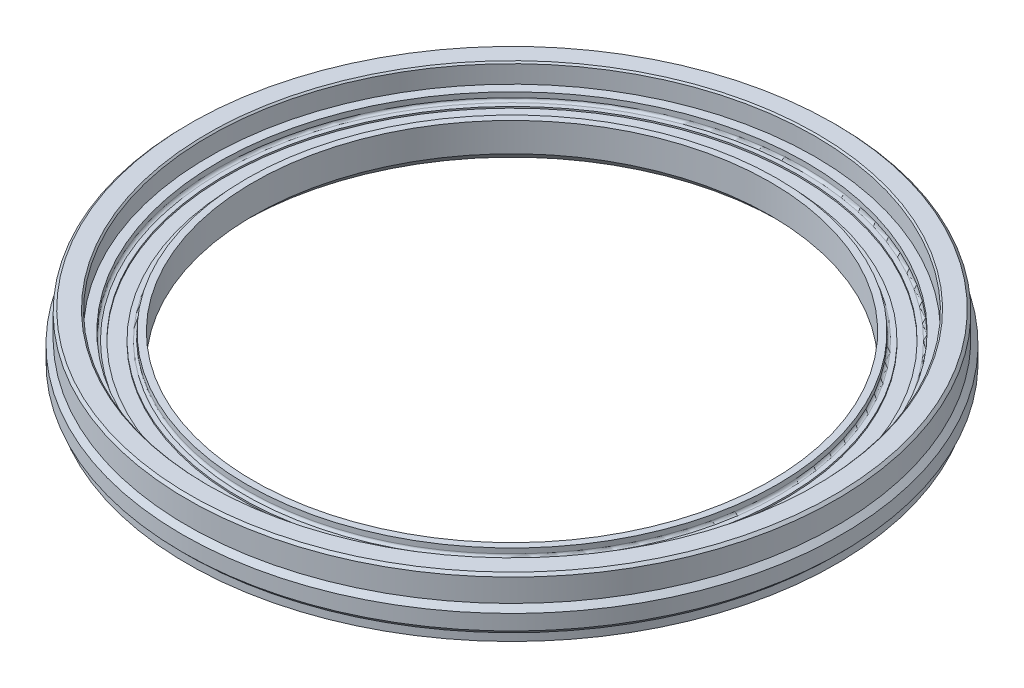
ISO-10303-21;
HEADER;
FILE_DESCRIPTION(('STEP AP214'),'2;1');
FILE_NAME('part.step','',(''),(''),'','','');
FILE_SCHEMA(('AUTOMOTIVE_DESIGN { 1 0 10303 214 1 1 1 1 }'));
ENDSEC;
DATA;
#1=APPLICATION_CONTEXT('core data for automotive mechanical design processes');
#2=APPLICATION_PROTOCOL_DEFINITION('international standard','automotive_design',2000,#1);
#3=PRODUCT_CONTEXT('',#1,'mechanical');
#4=PRODUCT('Part','Part','',(#3));
#5=PRODUCT_RELATED_PRODUCT_CATEGORY('part','',(#4));
#6=PRODUCT_DEFINITION_FORMATION('','',#4);
#7=PRODUCT_DEFINITION_CONTEXT('part definition',#1,'design');
#8=PRODUCT_DEFINITION('design','',#6,#7);
#9=PRODUCT_DEFINITION_SHAPE('','',#8);
#10=(LENGTH_UNIT() NAMED_UNIT(*) SI_UNIT(.MILLI.,.METRE.));
#11=(NAMED_UNIT(*) PLANE_ANGLE_UNIT() SI_UNIT($,.RADIAN.));
#12=(NAMED_UNIT(*) SI_UNIT($,.STERADIAN.) SOLID_ANGLE_UNIT());
#13=UNCERTAINTY_MEASURE_WITH_UNIT(LENGTH_MEASURE(1.E-05),#10,'distance_accuracy_value','');
#14=(GEOMETRIC_REPRESENTATION_CONTEXT(3) GLOBAL_UNCERTAINTY_ASSIGNED_CONTEXT((#13)) GLOBAL_UNIT_ASSIGNED_CONTEXT((#10,
#11,#12)) REPRESENTATION_CONTEXT('',''));
#15=CARTESIAN_POINT('',(0.,0.,0.));
#16=DIRECTION('',(0.,0.,1.));
#17=DIRECTION('',(1.,0.,0.));
#18=AXIS2_PLACEMENT_3D('',#15,#16,#17);
#19=CARTESIAN_POINT('',(0.,6.70000000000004,0.));
#20=DIRECTION('',(0.,-1.,0.));
#21=DIRECTION('',(-1.,0.,0.));
#22=AXIS2_PLACEMENT_3D('',#19,#20,#21);
#23=TOROIDAL_SURFACE('',#22,57.4,0.5);
#24=CARTESIAN_POINT('',(0.,6.70000000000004,0.));
#25=DIRECTION('',(0.,-1.,0.));
#26=DIRECTION('',(0.,0.,-1.));
#27=AXIS2_PLACEMENT_3D('',#24,#25,#26);
#28=CIRCLE('',#27,57.9);
#29=CARTESIAN_POINT('',(0.,6.70000000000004,-57.9));
#30=VERTEX_POINT('',#29);
#31=EDGE_CURVE('E59',#30,#30,#28,.F.);
#32=ORIENTED_EDGE('',*,*,#31,.T.);
#33=EDGE_LOOP('',(#32));
#34=FACE_BOUND('',#33,.T.);
#35=CARTESIAN_POINT('',(0.,6.20000000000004,0.));
#36=DIRECTION('',(0.,-1.,0.));
#37=DIRECTION('',(-1.,0.,0.));
#38=AXIS2_PLACEMENT_3D('',#35,#36,#37);
#39=CIRCLE('',#38,57.4);
#40=CARTESIAN_POINT('',(-57.4,6.20000000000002,0.));
#41=VERTEX_POINT('',#40);
#42=CARTESIAN_POINT('',(57.4,6.20000000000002,0.));
#43=VERTEX_POINT('',#42);
#44=EDGE_CURVE('E53',#41,#43,#39,.T.);
#45=ORIENTED_EDGE('',*,*,#44,.T.);
#46=CARTESIAN_POINT('',(0.,6.20000000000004,0.));
#47=DIRECTION('',(0.,-1.,0.));
#48=DIRECTION('',(1.,0.,0.));
#49=AXIS2_PLACEMENT_3D('',#46,#47,#48);
#50=CIRCLE('',#49,57.4);
#51=EDGE_CURVE('E56',#43,#41,#50,.T.);
#52=ORIENTED_EDGE('',*,*,#51,.T.);
#53=EDGE_LOOP('',(#45,#52));
#54=FACE_BOUND('',#53,.T.);
#55=ADVANCED_FACE('F16',(#34,#54),#23,.F.);
#56=CARTESIAN_POINT('',(0.,12.0749999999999,0.));
#57=DIRECTION('',(0.,-1.,0.));
#58=DIRECTION('',(0.,0.,-1.));
#59=AXIS2_PLACEMENT_3D('',#56,#57,#58);
#60=CYLINDRICAL_SURFACE('',#59,57.9);
#61=ORIENTED_EDGE('',*,*,#31,.F.);
#62=EDGE_LOOP('',(#61));
#63=FACE_BOUND('',#62,.T.);
#64=CARTESIAN_POINT('',(0.,7.70000000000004,0.));
#65=DIRECTION('',(0.,-1.,0.));
#66=DIRECTION('',(0.,0.,-1.));
#67=AXIS2_PLACEMENT_3D('',#64,#65,#66);
#68=CIRCLE('',#67,57.9);
#69=CARTESIAN_POINT('',(0.,7.70000000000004,-57.9));
#70=VERTEX_POINT('',#69);
#71=EDGE_CURVE('E64',#70,#70,#68,.F.);
#72=ORIENTED_EDGE('',*,*,#71,.T.);
#73=EDGE_LOOP('',(#72));
#74=FACE_BOUND('',#73,.T.);
#75=ADVANCED_FACE('F82',(#63,#74),#60,.F.);
#76=CARTESIAN_POINT('',(0.,6.19999999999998,0.));
#77=DIRECTION('',(0.,-1.,0.));
#78=DIRECTION('',(0.,0.,-1.));
#79=AXIS2_PLACEMENT_3D('',#76,#77,#78);
#80=PLANE('',#79);
#81=ORIENTED_EDGE('',*,*,#51,.F.);
#82=ORIENTED_EDGE('',*,*,#44,.F.);
#83=EDGE_LOOP('',(#81,#82));
#84=FACE_BOUND('',#83,.T.);
#85=CARTESIAN_POINT('',(0.,6.19999999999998,0.));
#86=DIRECTION('',(0.,-1.,0.));
#87=DIRECTION('',(0.,0.,-1.));
#88=AXIS2_PLACEMENT_3D('',#85,#86,#87);
#89=CIRCLE('',#88,56.5);
#90=CARTESIAN_POINT('',(0.,6.19999999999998,-56.5));
#91=VERTEX_POINT('',#90);
#92=EDGE_CURVE('E240',#91,#91,#89,.T.);
#93=ORIENTED_EDGE('',*,*,#92,.T.);
#94=EDGE_LOOP('',(#93));
#95=FACE_BOUND('',#94,.T.);
#96=ADVANCED_FACE('F62',(#84,#95),#80,.F.);
#97=CARTESIAN_POINT('',(0.,7.70000000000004,0.));
#98=DIRECTION('',(0.,-1.,0.));
#99=DIRECTION('',(0.,0.,-1.));
#100=AXIS2_PLACEMENT_3D('',#97,#98,#99);
#101=PLANE('',#100);
#102=CARTESIAN_POINT('',(0.,7.70000000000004,0.));
#103=DIRECTION('',(0.,-1.,0.));
#104=DIRECTION('',(0.,0.,-1.));
#105=AXIS2_PLACEMENT_3D('',#102,#103,#104);
#106=CIRCLE('',#105,59.75);
#107=CARTESIAN_POINT('',(0.,7.70000000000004,-59.75));
#108=VERTEX_POINT('',#107);
#109=EDGE_CURVE('E235',#108,#108,#106,.F.);
#110=ORIENTED_EDGE('',*,*,#109,.T.);
#111=EDGE_LOOP('',(#110));
#112=FACE_BOUND('',#111,.T.);
#113=ORIENTED_EDGE('',*,*,#71,.F.);
#114=EDGE_LOOP('',(#113));
#115=FACE_BOUND('',#114,.T.);
#116=ADVANCED_FACE('F81',(#112,#115),#101,.F.);
#117=CARTESIAN_POINT('',(0.,12.0749999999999,0.));
#118=DIRECTION('',(0.,-1.,0.));
#119=DIRECTION('',(0.,0.,-1.));
#120=AXIS2_PLACEMENT_3D('',#117,#118,#119);
#121=CYLINDRICAL_SURFACE('',#120,56.5);
#122=ORIENTED_EDGE('',*,*,#92,.F.);
#123=EDGE_LOOP('',(#122));
#124=FACE_BOUND('',#123,.T.);
#125=CARTESIAN_POINT('',(0.,5.90000000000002,0.));
#126=DIRECTION('',(0.,-1.,0.));
#127=DIRECTION('',(0.,0.,-1.));
#128=AXIS2_PLACEMENT_3D('',#125,#126,#127);
#129=CIRCLE('',#128,56.5);
#130=CARTESIAN_POINT('',(0.,5.90000000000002,-56.5));
#131=VERTEX_POINT('',#130);
#132=EDGE_CURVE('E228',#131,#131,#129,.T.);
#133=ORIENTED_EDGE('',*,*,#132,.T.);
#134=EDGE_LOOP('',(#133));
#135=FACE_BOUND('',#134,.T.);
#136=ADVANCED_FACE('F293',(#124,#135),#121,.F.);
#137=CARTESIAN_POINT('',(0.,12.0749999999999,0.));
#138=DIRECTION('',(0.,-1.,0.));
#139=DIRECTION('',(0.,0.,-1.));
#140=AXIS2_PLACEMENT_3D('',#137,#138,#139);
#141=CYLINDRICAL_SURFACE('',#140,59.75);
#142=CARTESIAN_POINT('',(0.,11.2,0.));
#143=DIRECTION('',(0.,1.,0.));
#144=DIRECTION('',(0.,0.,1.));
#145=AXIS2_PLACEMENT_3D('',#142,#143,#144);
#146=CIRCLE('',#145,59.75);
#147=CARTESIAN_POINT('',(0.,11.2,59.75));
#148=VERTEX_POINT('',#147);
#149=EDGE_CURVE('E220',#148,#148,#146,.T.);
#150=ORIENTED_EDGE('',*,*,#149,.T.);
#151=EDGE_LOOP('',(#150));
#152=FACE_BOUND('',#151,.T.);
#153=ORIENTED_EDGE('',*,*,#109,.F.);
#154=EDGE_LOOP('',(#153));
#155=FACE_BOUND('',#154,.T.);
#156=ADVANCED_FACE('F290',(#152,#155),#141,.F.);
#157=CARTESIAN_POINT('',(0.,5.90000000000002,0.));
#158=DIRECTION('',(0.,-1.,0.));
#159=DIRECTION('',(0.,0.,-1.));
#160=AXIS2_PLACEMENT_3D('',#157,#158,#159);
#161=PLANE('',#160);
#162=ORIENTED_EDGE('',*,*,#132,.F.);
#163=EDGE_LOOP('',(#162));
#164=FACE_BOUND('',#163,.T.);
#165=CARTESIAN_POINT('',(0.,5.90000000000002,0.));
#166=DIRECTION('',(0.,-1.,0.));
#167=DIRECTION('',(0.,0.,-1.));
#168=AXIS2_PLACEMENT_3D('',#165,#166,#167);
#169=CIRCLE('',#168,53.7);
#170=CARTESIAN_POINT('',(0.,5.90000000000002,-53.7));
#171=VERTEX_POINT('',#170);
#172=EDGE_CURVE('E227',#171,#171,#169,.F.);
#173=ORIENTED_EDGE('',*,*,#172,.F.);
#174=EDGE_LOOP('',(#173));
#175=FACE_BOUND('',#174,.T.);
#176=ADVANCED_FACE('F283',(#164,#175),#161,.F.);
#177=CARTESIAN_POINT('',(0.,11.5000000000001,0.));
#178=DIRECTION('',(0.,1.,0.));
#179=DIRECTION('',(0.,0.,1.));
#180=AXIS2_PLACEMENT_3D('',#177,#178,#179);
#181=CONICAL_SURFACE('',#180,60.05,0.785398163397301);
#182=ORIENTED_EDGE('',*,*,#149,.F.);
#183=EDGE_LOOP('',(#182));
#184=FACE_BOUND('',#183,.T.);
#185=CARTESIAN_POINT('',(0.,11.5000000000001,0.));
#186=DIRECTION('',(0.,1.,0.));
#187=DIRECTION('',(0.,0.,1.));
#188=AXIS2_PLACEMENT_3D('',#185,#186,#187);
#189=CIRCLE('',#188,60.05);
#190=CARTESIAN_POINT('',(0.,11.5000000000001,60.05));
#191=VERTEX_POINT('',#190);
#192=EDGE_CURVE('E232',#191,#191,#189,.T.);
#193=ORIENTED_EDGE('',*,*,#192,.T.);
#194=EDGE_LOOP('',(#193));
#195=FACE_BOUND('',#194,.T.);
#196=ADVANCED_FACE('F271',(#184,#195),#181,.F.);
#197=CARTESIAN_POINT('',(0.,12.0749999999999,0.));
#198=DIRECTION('',(0.,-1.,0.));
#199=DIRECTION('',(0.,0.,-1.));
#200=AXIS2_PLACEMENT_3D('',#197,#198,#199);
#201=CYLINDRICAL_SURFACE('',#200,53.7);
#202=ORIENTED_EDGE('',*,*,#172,.T.);
#203=EDGE_LOOP('',(#202));
#204=FACE_BOUND('',#203,.T.);
#205=CARTESIAN_POINT('',(0.,6.19999999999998,0.));
#206=DIRECTION('',(0.,-1.,0.));
#207=DIRECTION('',(0.,0.,-1.));
#208=AXIS2_PLACEMENT_3D('',#205,#206,#207);
#209=CIRCLE('',#208,53.7);
#210=CARTESIAN_POINT('',(0.,6.19999999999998,-53.7));
#211=VERTEX_POINT('',#210);
#212=EDGE_CURVE('E259',#211,#211,#209,.T.);
#213=ORIENTED_EDGE('',*,*,#212,.T.);
#214=EDGE_LOOP('',(#213));
#215=FACE_BOUND('',#214,.T.);
#216=ADVANCED_FACE('F274',(#204,#215),#201,.T.);
#217=CARTESIAN_POINT('',(0.,11.5,0.));
#218=DIRECTION('',(0.,-1.,0.));
#219=DIRECTION('',(0.,0.,-1.));
#220=AXIS2_PLACEMENT_3D('',#217,#218,#219);
#221=PLANE('',#220);
#222=CARTESIAN_POINT('',(0.,11.5000000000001,0.));
#223=DIRECTION('',(0.,-1.,0.));
#224=DIRECTION('',(0.,0.,-1.));
#225=AXIS2_PLACEMENT_3D('',#222,#223,#224);
#226=CIRCLE('',#225,63.5000000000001);
#227=CARTESIAN_POINT('',(0.,11.5000000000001,-63.5000000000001));
#228=VERTEX_POINT('',#227);
#229=EDGE_CURVE('E257',#228,#228,#226,.T.);
#230=ORIENTED_EDGE('',*,*,#229,.F.);
#231=EDGE_LOOP('',(#230));
#232=FACE_BOUND('',#231,.T.);
#233=ORIENTED_EDGE('',*,*,#192,.F.);
#234=EDGE_LOOP('',(#233));
#235=FACE_BOUND('',#234,.T.);
#236=ADVANCED_FACE('F205',(#232,#235),#221,.F.);
#237=CARTESIAN_POINT('',(0.,6.19999999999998,0.));
#238=DIRECTION('',(0.,-1.,0.));
#239=DIRECTION('',(0.,0.,-1.));
#240=AXIS2_PLACEMENT_3D('',#237,#238,#239);
#241=PLANE('',#240);
#242=ORIENTED_EDGE('',*,*,#212,.F.);
#243=EDGE_LOOP('',(#242));
#244=FACE_BOUND('',#243,.T.);
#245=CARTESIAN_POINT('',(0.,6.20000000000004,0.));
#246=DIRECTION('',(0.,1.,0.));
#247=DIRECTION('',(1.,0.,0.));
#248=AXIS2_PLACEMENT_3D('',#245,#246,#247);
#249=CIRCLE('',#248,52.8);
#250=CARTESIAN_POINT('',(-52.8,6.20000000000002,0.));
#251=VERTEX_POINT('',#250);
#252=CARTESIAN_POINT('',(52.8,6.20000000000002,0.));
#253=VERTEX_POINT('',#252);
#254=EDGE_CURVE('E187',#251,#253,#249,.F.);
#255=ORIENTED_EDGE('',*,*,#254,.T.);
#256=CARTESIAN_POINT('',(0.,6.20000000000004,0.));
#257=DIRECTION('',(0.,1.,0.));
#258=DIRECTION('',(-1.,0.,0.));
#259=AXIS2_PLACEMENT_3D('',#256,#257,#258);
#260=CIRCLE('',#259,52.8);
#261=EDGE_CURVE('E248',#253,#251,#260,.F.);
#262=ORIENTED_EDGE('',*,*,#261,.T.);
#263=EDGE_LOOP('',(#255,#262));
#264=FACE_BOUND('',#263,.T.);
#265=ADVANCED_FACE('F196',(#244,#264),#241,.F.);
#266=CARTESIAN_POINT('',(0.,11.,0.));
#267=DIRECTION('',(0.,-1.,0.));
#268=DIRECTION('',(0.,0.,-1.));
#269=AXIS2_PLACEMENT_3D('',#266,#267,#268);
#270=CONICAL_SURFACE('',#269,64.,0.785398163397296);
#271=ORIENTED_EDGE('',*,*,#229,.T.);
#272=EDGE_LOOP('',(#271));
#273=FACE_BOUND('',#272,.T.);
#274=CARTESIAN_POINT('',(0.,11.,0.));
#275=DIRECTION('',(0.,-1.,0.));
#276=DIRECTION('',(0.,0.,-1.));
#277=AXIS2_PLACEMENT_3D('',#274,#275,#276);
#278=CIRCLE('',#277,64.);
#279=CARTESIAN_POINT('',(0.,11.,-64.));
#280=VERTEX_POINT('',#279);
#281=EDGE_CURVE('E184',#280,#280,#278,.T.);
#282=ORIENTED_EDGE('',*,*,#281,.F.);
#283=EDGE_LOOP('',(#282));
#284=FACE_BOUND('',#283,.T.);
#285=ADVANCED_FACE('F174',(#273,#284),#270,.T.);
#286=CARTESIAN_POINT('',(0.,6.70000000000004,0.));
#287=DIRECTION('',(0.,-1.,0.));
#288=DIRECTION('',(-1.,0.,0.));
#289=AXIS2_PLACEMENT_3D('',#286,#287,#288);
#290=TOROIDAL_SURFACE('',#289,52.8,0.5);
#291=ORIENTED_EDGE('',*,*,#254,.F.);
#292=ORIENTED_EDGE('',*,*,#261,.F.);
#293=EDGE_LOOP('',(#291,#292));
#294=FACE_BOUND('',#293,.T.);
#295=CARTESIAN_POINT('',(0.,6.70000000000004,0.));
#296=DIRECTION('',(0.,-1.,0.));
#297=DIRECTION('',(0.,0.,-1.));
#298=AXIS2_PLACEMENT_3D('',#295,#296,#297);
#299=CIRCLE('',#298,52.3);
#300=CARTESIAN_POINT('',(0.,6.70000000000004,-52.3));
#301=VERTEX_POINT('',#300);
#302=EDGE_CURVE('E182',#301,#301,#299,.F.);
#303=ORIENTED_EDGE('',*,*,#302,.F.);
#304=EDGE_LOOP('',(#303));
#305=FACE_BOUND('',#304,.T.);
#306=ADVANCED_FACE('F168',(#294,#305),#290,.F.);
#307=CARTESIAN_POINT('',(0.,12.0749999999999,0.));
#308=DIRECTION('',(0.,-1.,0.));
#309=DIRECTION('',(0.,0.,-1.));
#310=AXIS2_PLACEMENT_3D('',#307,#308,#309);
#311=CYLINDRICAL_SURFACE('',#310,64.);
#312=ORIENTED_EDGE('',*,*,#281,.T.);
#313=EDGE_LOOP('',(#312));
#314=FACE_BOUND('',#313,.T.);
#315=CARTESIAN_POINT('',(0.,6.50000000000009,0.));
#316=DIRECTION('',(0.,-1.,0.));
#317=DIRECTION('',(0.,0.,-1.));
#318=AXIS2_PLACEMENT_3D('',#315,#316,#317);
#319=CIRCLE('',#318,64.0000000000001);
#320=CARTESIAN_POINT('',(0.,6.50000000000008,-64.0000000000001));
#321=VERTEX_POINT('',#320);
#322=EDGE_CURVE('E496',#321,#321,#319,.T.);
#323=ORIENTED_EDGE('',*,*,#322,.F.);
#324=EDGE_LOOP('',(#323));
#325=FACE_BOUND('',#324,.T.);
#326=ADVANCED_FACE('F164',(#314,#325),#311,.T.);
#327=CARTESIAN_POINT('',(0.,12.0749999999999,0.));
#328=DIRECTION('',(0.,-1.,0.));
#329=DIRECTION('',(0.,0.,-1.));
#330=AXIS2_PLACEMENT_3D('',#327,#328,#329);
#331=CYLINDRICAL_SURFACE('',#330,52.3);
#332=ORIENTED_EDGE('',*,*,#302,.T.);
#333=EDGE_LOOP('',(#332));
#334=FACE_BOUND('',#333,.T.);
#335=CARTESIAN_POINT('',(0.,7.70000000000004,0.));
#336=DIRECTION('',(0.,-1.,0.));
#337=DIRECTION('',(0.,0.,-1.));
#338=AXIS2_PLACEMENT_3D('',#335,#336,#337);
#339=CIRCLE('',#338,52.3);
#340=CARTESIAN_POINT('',(0.,7.70000000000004,-52.3));
#341=VERTEX_POINT('',#340);
#342=EDGE_CURVE('E266',#341,#341,#339,.T.);
#343=ORIENTED_EDGE('',*,*,#342,.T.);
#344=EDGE_LOOP('',(#343));
#345=FACE_BOUND('',#344,.T.);
#346=ADVANCED_FACE('F160',(#334,#345),#331,.T.);
#347=CARTESIAN_POINT('',(0.,5.49999999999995,0.));
#348=DIRECTION('',(0.,-1.,0.));
#349=DIRECTION('',(0.,0.,-1.));
#350=AXIS2_PLACEMENT_3D('',#347,#348,#349);
#351=CONICAL_SURFACE('',#350,64.9999999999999,0.785398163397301);
#352=ORIENTED_EDGE('',*,*,#322,.T.);
#353=EDGE_LOOP('',(#352));
#354=FACE_BOUND('',#353,.T.);
#355=CARTESIAN_POINT('',(0.,5.49999999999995,0.));
#356=DIRECTION('',(0.,-1.,0.));
#357=DIRECTION('',(0.,0.,-1.));
#358=AXIS2_PLACEMENT_3D('',#355,#356,#357);
#359=CIRCLE('',#358,65.);
#360=CARTESIAN_POINT('',(0.,5.49999999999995,-65.));
#361=VERTEX_POINT('',#360);
#362=EDGE_CURVE('E498',#361,#361,#359,.T.);
#363=ORIENTED_EDGE('',*,*,#362,.F.);
#364=EDGE_LOOP('',(#363));
#365=FACE_BOUND('',#364,.T.);
#366=ADVANCED_FACE('F156',(#354,#365),#351,.T.);
#367=CARTESIAN_POINT('',(0.,7.70000000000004,0.));
#368=DIRECTION('',(0.,-1.,0.));
#369=DIRECTION('',(0.,0.,-1.));
#370=AXIS2_PLACEMENT_3D('',#367,#368,#369);
#371=PLANE('',#370);
#372=ORIENTED_EDGE('',*,*,#342,.F.);
#373=EDGE_LOOP('',(#372));
#374=FACE_BOUND('',#373,.T.);
#375=CARTESIAN_POINT('',(0.,7.70000000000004,0.));
#376=DIRECTION('',(0.,-1.,0.));
#377=DIRECTION('',(0.,0.,-1.));
#378=AXIS2_PLACEMENT_3D('',#375,#376,#377);
#379=CIRCLE('',#378,51.);
#380=CARTESIAN_POINT('',(0.,7.70000000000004,-51.));
#381=VERTEX_POINT('',#380);
#382=EDGE_CURVE('E503',#381,#381,#379,.T.);
#383=ORIENTED_EDGE('',*,*,#382,.T.);
#384=EDGE_LOOP('',(#383));
#385=FACE_BOUND('',#384,.T.);
#386=ADVANCED_FACE('F152',(#374,#385),#371,.F.);
#387=CARTESIAN_POINT('',(0.,12.0749999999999,0.));
#388=DIRECTION('',(0.,-1.,0.));
#389=DIRECTION('',(0.,0.,-1.));
#390=AXIS2_PLACEMENT_3D('',#387,#388,#389);
#391=CYLINDRICAL_SURFACE('',#390,65.);
#392=ORIENTED_EDGE('',*,*,#362,.T.);
#393=EDGE_LOOP('',(#392));
#394=FACE_BOUND('',#393,.T.);
#395=CARTESIAN_POINT('',(0.,2.50000000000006,0.));
#396=DIRECTION('',(0.,1.,0.));
#397=DIRECTION('',(0.,0.,1.));
#398=AXIS2_PLACEMENT_3D('',#395,#396,#397);
#399=CIRCLE('',#398,64.9999999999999);
#400=CARTESIAN_POINT('',(0.,2.50000000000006,64.9999999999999));
#401=VERTEX_POINT('',#400);
#402=EDGE_CURVE('E504',#401,#401,#399,.F.);
#403=ORIENTED_EDGE('',*,*,#402,.F.);
#404=EDGE_LOOP('',(#403));
#405=FACE_BOUND('',#404,.T.);
#406=ADVANCED_FACE('F148',(#394,#405),#391,.T.);
#407=CARTESIAN_POINT('',(-60.,5.99999999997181,0.));
#408=DIRECTION('',(0.,-1.,0.));
#409=DIRECTION('',(0.,0.,-1.));
#410=AXIS2_PLACEMENT_3D('',#407,#408,#409);
#411=CONICAL_SURFACE('',#410,1.65000000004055,1.02974425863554);
#412=CARTESIAN_POINT('',(-60.,6.99142002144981,0.));
#413=VERTEX_POINT('',#412);
#414=VERTEX_LOOP('',#413);
#415=FACE_BOUND('',#414,.T.);
#416=CARTESIAN_POINT('',(-60.,6.00000000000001,0.));
#417=DIRECTION('',(0.,-1.,0.));
#418=DIRECTION('',(0.,0.,-1.));
#419=AXIS2_PLACEMENT_3D('',#416,#417,#418);
#420=CIRCLE('',#419,1.65);
#421=CARTESIAN_POINT('',(-60.,6.00000000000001,-1.65000000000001));
#422=VERTEX_POINT('',#421);
#423=EDGE_CURVE('E507',#422,#422,#420,.T.);
#424=ORIENTED_EDGE('',*,*,#423,.T.);
#425=EDGE_LOOP('',(#424));
#426=FACE_BOUND('',#425,.T.);
#427=ADVANCED_FACE('F144',(#415,#426),#411,.F.);
#428=CARTESIAN_POINT('',(0.,5.99999999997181,-60.));
#429=DIRECTION('',(0.,-1.,0.));
#430=DIRECTION('',(0.,0.,-1.));
#431=AXIS2_PLACEMENT_3D('',#428,#429,#430);
#432=CONICAL_SURFACE('',#431,1.65000000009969,1.02974425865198);
#433=CARTESIAN_POINT('',(0.,6.99142002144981,-60.));
#434=VERTEX_POINT('',#433);
#435=VERTEX_LOOP('',#434);
#436=FACE_BOUND('',#435,.T.);
#437=CARTESIAN_POINT('',(0.,6.00000000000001,-60.));
#438=DIRECTION('',(0.,-1.,0.));
#439=DIRECTION('',(0.,0.,-1.));
#440=AXIS2_PLACEMENT_3D('',#437,#438,#439);
#441=CIRCLE('',#440,1.65);
#442=CARTESIAN_POINT('',(0.,6.00000000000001,-61.65));
#443=VERTEX_POINT('',#442);
#444=EDGE_CURVE('E510',#443,#443,#441,.T.);
#445=ORIENTED_EDGE('',*,*,#444,.T.);
#446=EDGE_LOOP('',(#445));
#447=FACE_BOUND('',#446,.T.);
#448=ADVANCED_FACE('F140',(#436,#447),#432,.F.);
#449=CARTESIAN_POINT('',(60.,5.99999999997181,0.));
#450=DIRECTION('',(0.,-1.,0.));
#451=DIRECTION('',(0.,0.,-1.));
#452=AXIS2_PLACEMENT_3D('',#449,#450,#451);
#453=CONICAL_SURFACE('',#452,1.65000000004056,1.02974425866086);
#454=CARTESIAN_POINT('',(60.,6.99142002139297,0.));
#455=VERTEX_POINT('',#454);
#456=VERTEX_LOOP('',#455);
#457=FACE_BOUND('',#456,.T.);
#458=CARTESIAN_POINT('',(60.,6.00000000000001,0.));
#459=DIRECTION('',(0.,-1.,0.));
#460=DIRECTION('',(0.,0.,-1.));
#461=AXIS2_PLACEMENT_3D('',#458,#459,#460);
#462=CIRCLE('',#461,1.65);
#463=CARTESIAN_POINT('',(60.,6.00000000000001,-1.65));
#464=VERTEX_POINT('',#463);
#465=EDGE_CURVE('E513',#464,#464,#462,.T.);
#466=ORIENTED_EDGE('',*,*,#465,.T.);
#467=EDGE_LOOP('',(#466));
#468=FACE_BOUND('',#467,.T.);
#469=ADVANCED_FACE('F137',(#457,#468),#453,.F.);
#470=CARTESIAN_POINT('',(0.,6.00000000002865,60.));
#471=DIRECTION('',(0.,-1.,0.));
#472=DIRECTION('',(0.,0.,-1.));
#473=AXIS2_PLACEMENT_3D('',#470,#471,#472);
#474=CONICAL_SURFACE('',#473,1.65000000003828,1.02974425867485);
#475=CARTESIAN_POINT('',(0.,6.99142002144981,60.));
#476=VERTEX_POINT('',#475);
#477=VERTEX_LOOP('',#476);
#478=FACE_BOUND('',#477,.T.);
#479=CARTESIAN_POINT('',(0.,6.00000000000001,60.));
#480=DIRECTION('',(0.,-1.,0.));
#481=DIRECTION('',(0.,0.,-1.));
#482=AXIS2_PLACEMENT_3D('',#479,#480,#481);
#483=CIRCLE('',#482,1.65);
#484=CARTESIAN_POINT('',(0.,6.00000000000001,58.35));
#485=VERTEX_POINT('',#484);
#486=EDGE_CURVE('E516',#485,#485,#483,.T.);
#487=ORIENTED_EDGE('',*,*,#486,.T.);
#488=EDGE_LOOP('',(#487));
#489=FACE_BOUND('',#488,.T.);
#490=ADVANCED_FACE('F133',(#478,#489),#474,.F.);
#491=CARTESIAN_POINT('',(0.,12.0749999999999,0.));
#492=DIRECTION('',(0.,-1.,0.));
#493=DIRECTION('',(0.,0.,-1.));
#494=AXIS2_PLACEMENT_3D('',#491,#492,#493);
#495=CYLINDRICAL_SURFACE('',#494,51.);
#496=ORIENTED_EDGE('',*,*,#382,.F.);
#497=EDGE_LOOP('',(#496));
#498=FACE_BOUND('',#497,.T.);
#499=CARTESIAN_POINT('',(0.,2.00000000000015,0.));
#500=DIRECTION('',(0.,-1.,0.));
#501=DIRECTION('',(0.,0.,-1.));
#502=AXIS2_PLACEMENT_3D('',#499,#500,#501);
#503=CIRCLE('',#502,51.0000000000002);
#504=CARTESIAN_POINT('',(0.,2.00000000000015,-51.0000000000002));
#505=VERTEX_POINT('',#504);
#506=EDGE_CURVE('E519',#505,#505,#503,.T.);
#507=ORIENTED_EDGE('',*,*,#506,.T.);
#508=EDGE_LOOP('',(#507));
#509=FACE_BOUND('',#508,.T.);
#510=ADVANCED_FACE('F129',(#498,#509),#495,.F.);
#511=CARTESIAN_POINT('',(0.,2.50000000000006,0.));
#512=DIRECTION('',(0.,1.,0.));
#513=DIRECTION('',(0.,0.,1.));
#514=AXIS2_PLACEMENT_3D('',#511,#512,#513);
#515=CONICAL_SURFACE('',#514,64.9999999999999,0.785398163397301);
#516=CARTESIAN_POINT('',(0.,1.49999999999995,0.));
#517=DIRECTION('',(0.,-1.,0.));
#518=DIRECTION('',(0.,0.,-1.));
#519=AXIS2_PLACEMENT_3D('',#516,#517,#518);
#520=CIRCLE('',#519,64.);
#521=CARTESIAN_POINT('',(0.,1.49999999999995,-64.));
#522=VERTEX_POINT('',#521);
#523=EDGE_CURVE('E522',#522,#522,#520,.T.);
#524=ORIENTED_EDGE('',*,*,#523,.F.);
#525=EDGE_LOOP('',(#524));
#526=FACE_BOUND('',#525,.T.);
#527=ORIENTED_EDGE('',*,*,#402,.T.);
#528=EDGE_LOOP('',(#527));
#529=FACE_BOUND('',#528,.T.);
#530=ADVANCED_FACE('F125',(#526,#529),#515,.T.);
#531=CARTESIAN_POINT('',(-60.,7.34099102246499,0.));
#532=DIRECTION('',(0.,-1.,0.));
#533=DIRECTION('',(0.,0.,-1.));
#534=AXIS2_PLACEMENT_3D('',#531,#532,#533);
#535=CYLINDRICAL_SURFACE('',#534,1.65);
#536=ORIENTED_EDGE('',*,*,#423,.F.);
#537=EDGE_LOOP('',(#536));
#538=FACE_BOUND('',#537,.T.);
#539=CARTESIAN_POINT('',(-60.,0.,0.));
#540=DIRECTION('',(0.,-1.,0.));
#541=DIRECTION('',(0.,0.,-1.));
#542=AXIS2_PLACEMENT_3D('',#539,#540,#541);
#543=CIRCLE('',#542,1.65);
#544=CARTESIAN_POINT('',(-60.,0.,-1.65000000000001));
#545=VERTEX_POINT('',#544);
#546=EDGE_CURVE('E524',#545,#545,#543,.F.);
#547=ORIENTED_EDGE('',*,*,#546,.F.);
#548=EDGE_LOOP('',(#547));
#549=FACE_BOUND('',#548,.T.);
#550=ADVANCED_FACE('F121',(#538,#549),#535,.F.);
#551=CARTESIAN_POINT('',(0.,7.34099102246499,-60.));
#552=DIRECTION('',(0.,-1.,0.));
#553=DIRECTION('',(0.,0.,-1.));
#554=AXIS2_PLACEMENT_3D('',#551,#552,#553);
#555=CYLINDRICAL_SURFACE('',#554,1.65);
#556=ORIENTED_EDGE('',*,*,#444,.F.);
#557=EDGE_LOOP('',(#556));
#558=FACE_BOUND('',#557,.T.);
#559=CARTESIAN_POINT('',(0.,0.,-60.));
#560=DIRECTION('',(0.,-1.,0.));
#561=DIRECTION('',(0.,0.,-1.));
#562=AXIS2_PLACEMENT_3D('',#559,#560,#561);
#563=CIRCLE('',#562,1.65);
#564=CARTESIAN_POINT('',(0.,0.,-61.65));
#565=VERTEX_POINT('',#564);
#566=EDGE_CURVE('E527',#565,#565,#563,.F.);
#567=ORIENTED_EDGE('',*,*,#566,.F.);
#568=EDGE_LOOP('',(#567));
#569=FACE_BOUND('',#568,.T.);
#570=ADVANCED_FACE('F117',(#558,#569),#555,.F.);
#571=CARTESIAN_POINT('',(60.,7.34099102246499,0.));
#572=DIRECTION('',(0.,-1.,0.));
#573=DIRECTION('',(0.,0.,-1.));
#574=AXIS2_PLACEMENT_3D('',#571,#572,#573);
#575=CYLINDRICAL_SURFACE('',#574,1.65);
#576=ORIENTED_EDGE('',*,*,#465,.F.);
#577=EDGE_LOOP('',(#576));
#578=FACE_BOUND('',#577,.T.);
#579=CARTESIAN_POINT('',(60.,0.,0.));
#580=DIRECTION('',(0.,-1.,0.));
#581=DIRECTION('',(0.,0.,-1.));
#582=AXIS2_PLACEMENT_3D('',#579,#580,#581);
#583=CIRCLE('',#582,1.65);
#584=CARTESIAN_POINT('',(60.,0.,-1.65));
#585=VERTEX_POINT('',#584);
#586=EDGE_CURVE('E532',#585,#585,#583,.F.);
#587=ORIENTED_EDGE('',*,*,#586,.F.);
#588=EDGE_LOOP('',(#587));
#589=FACE_BOUND('',#588,.T.);
#590=ADVANCED_FACE('F113',(#578,#589),#575,.F.);
#591=CARTESIAN_POINT('',(0.,7.34099102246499,60.));
#592=DIRECTION('',(0.,-1.,0.));
#593=DIRECTION('',(0.,0.,-1.));
#594=AXIS2_PLACEMENT_3D('',#591,#592,#593);
#595=CYLINDRICAL_SURFACE('',#594,1.65);
#596=ORIENTED_EDGE('',*,*,#486,.F.);
#597=EDGE_LOOP('',(#596));
#598=FACE_BOUND('',#597,.T.);
#599=CARTESIAN_POINT('',(0.,0.,60.));
#600=DIRECTION('',(0.,-1.,0.));
#601=DIRECTION('',(0.,0.,-1.));
#602=AXIS2_PLACEMENT_3D('',#599,#600,#601);
#603=CIRCLE('',#602,1.65);
#604=CARTESIAN_POINT('',(0.,0.,58.35));
#605=VERTEX_POINT('',#604);
#606=EDGE_CURVE('E543',#605,#605,#603,.F.);
#607=ORIENTED_EDGE('',*,*,#606,.F.);
#608=EDGE_LOOP('',(#607));
#609=FACE_BOUND('',#608,.T.);
#610=ADVANCED_FACE('F109',(#598,#609),#595,.F.);
#611=CARTESIAN_POINT('',(0.,-1.11022302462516E-13,0.));
#612=DIRECTION('',(0.,-1.,0.));
#613=DIRECTION('',(0.,0.,-1.));
#614=AXIS2_PLACEMENT_3D('',#611,#612,#613);
#615=CONICAL_SURFACE('',#614,52.9999999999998,0.7853981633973);
#616=ORIENTED_EDGE('',*,*,#506,.F.);
#617=EDGE_LOOP('',(#616));
#618=FACE_BOUND('',#617,.T.);
#619=CARTESIAN_POINT('',(0.,-1.11022302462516E-13,0.));
#620=DIRECTION('',(0.,-1.,0.));
#621=DIRECTION('',(0.,0.,-1.));
#622=AXIS2_PLACEMENT_3D('',#619,#620,#621);
#623=CIRCLE('',#622,52.9999999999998);
#624=CARTESIAN_POINT('',(0.,-1.11022302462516E-13,-52.9999999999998));
#625=VERTEX_POINT('',#624);
#626=EDGE_CURVE('E28',#625,#625,#623,.F.);
#627=ORIENTED_EDGE('',*,*,#626,.F.);
#628=EDGE_LOOP('',(#627));
#629=FACE_BOUND('',#628,.T.);
#630=ADVANCED_FACE('F102',(#618,#629),#615,.F.);
#631=CARTESIAN_POINT('',(0.,12.0749999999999,0.));
#632=DIRECTION('',(0.,-1.,0.));
#633=DIRECTION('',(0.,0.,-1.));
#634=AXIS2_PLACEMENT_3D('',#631,#632,#633);
#635=CYLINDRICAL_SURFACE('',#634,64.);
#636=ORIENTED_EDGE('',*,*,#523,.T.);
#637=EDGE_LOOP('',(#636));
#638=FACE_BOUND('',#637,.T.);
#639=CARTESIAN_POINT('',(0.,0.,0.));
#640=DIRECTION('',(0.,-1.,0.));
#641=DIRECTION('',(0.,0.,-1.));
#642=AXIS2_PLACEMENT_3D('',#639,#640,#641);
#643=CIRCLE('',#642,64.);
#644=CARTESIAN_POINT('',(0.,0.,-64.));
#645=VERTEX_POINT('',#644);
#646=EDGE_CURVE('E11',#645,#645,#643,.T.);
#647=ORIENTED_EDGE('',*,*,#646,.F.);
#648=EDGE_LOOP('',(#647));
#649=FACE_BOUND('',#648,.T.);
#650=ADVANCED_FACE('F96',(#638,#649),#635,.T.);
#651=CARTESIAN_POINT('',(0.,0.,0.));
#652=DIRECTION('',(0.,-1.,0.));
#653=DIRECTION('',(0.,0.,-1.));
#654=AXIS2_PLACEMENT_3D('',#651,#652,#653);
#655=PLANE('',#654);
#656=ORIENTED_EDGE('',*,*,#646,.T.);
#657=EDGE_LOOP('',(#656));
#658=FACE_BOUND('',#657,.T.);
#659=ORIENTED_EDGE('',*,*,#626,.T.);
#660=EDGE_LOOP('',(#659));
#661=FACE_BOUND('',#660,.T.);
#662=ORIENTED_EDGE('',*,*,#606,.T.);
#663=EDGE_LOOP('',(#662));
#664=FACE_BOUND('',#663,.T.);
#665=ORIENTED_EDGE('',*,*,#586,.T.);
#666=EDGE_LOOP('',(#665));
#667=FACE_BOUND('',#666,.T.);
#668=ORIENTED_EDGE('',*,*,#566,.T.);
#669=EDGE_LOOP('',(#668));
#670=FACE_BOUND('',#669,.T.);
#671=ORIENTED_EDGE('',*,*,#546,.T.);
#672=EDGE_LOOP('',(#671));
#673=FACE_BOUND('',#672,.T.);
#674=ADVANCED_FACE('F94',(#658,#661,#664,#667,#670,#673),#655,.T.);
#675=CLOSED_SHELL('',(#55,#75,#96,#116,#136,#156,#176,#196,#216,#236,#265,#285,#306,#326,#346,
#366,#386,#406,#427,#448,#469,#490,#510,#530,#550,#570,#590,#610,#630,#650,#674));
#676=MANIFOLD_SOLID_BREP('B1',#675);
#677=ADVANCED_BREP_SHAPE_REPRESENTATION('',(#18,#676),#14);
#678=SHAPE_DEFINITION_REPRESENTATION(#9,#677);
ENDSEC;
END-ISO-10303-21;
